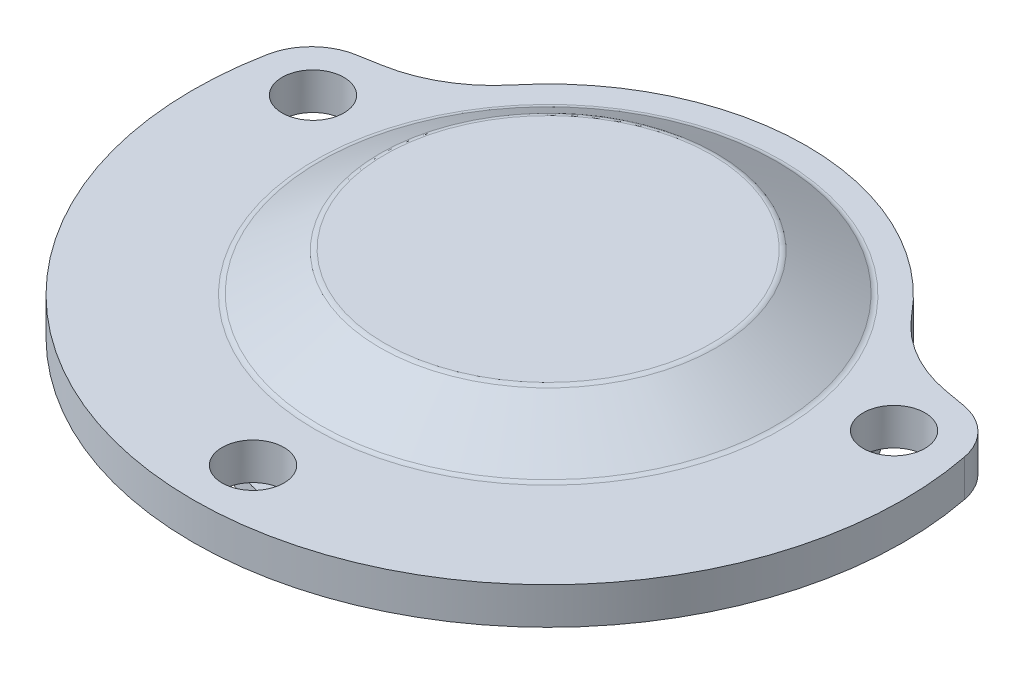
ISO-10303-21;
HEADER;
FILE_DESCRIPTION(('STEP AP214'),'2;1');
FILE_NAME('part.step','',(''),(''),'','','');
FILE_SCHEMA(('AUTOMOTIVE_DESIGN { 1 0 10303 214 1 1 1 1 }'));
ENDSEC;
DATA;
#1=APPLICATION_CONTEXT('core data for automotive mechanical design processes');
#2=APPLICATION_PROTOCOL_DEFINITION('international standard','automotive_design',2000,#1);
#3=PRODUCT_CONTEXT('',#1,'mechanical');
#4=PRODUCT('Part','Part','',(#3));
#5=PRODUCT_RELATED_PRODUCT_CATEGORY('part','',(#4));
#6=PRODUCT_DEFINITION_FORMATION('','',#4);
#7=PRODUCT_DEFINITION_CONTEXT('part definition',#1,'design');
#8=PRODUCT_DEFINITION('design','',#6,#7);
#9=PRODUCT_DEFINITION_SHAPE('','',#8);
#10=(LENGTH_UNIT() NAMED_UNIT(*) SI_UNIT(.MILLI.,.METRE.));
#11=(NAMED_UNIT(*) PLANE_ANGLE_UNIT() SI_UNIT($,.RADIAN.));
#12=(NAMED_UNIT(*) SI_UNIT($,.STERADIAN.) SOLID_ANGLE_UNIT());
#13=UNCERTAINTY_MEASURE_WITH_UNIT(LENGTH_MEASURE(1.E-05),#10,'distance_accuracy_value','');
#14=(GEOMETRIC_REPRESENTATION_CONTEXT(3) GLOBAL_UNCERTAINTY_ASSIGNED_CONTEXT((#13)) GLOBAL_UNIT_ASSIGNED_CONTEXT((#10,
#11,#12)) REPRESENTATION_CONTEXT('',''));
#15=CARTESIAN_POINT('',(0.,0.,0.));
#16=DIRECTION('',(0.,0.,1.));
#17=DIRECTION('',(1.,0.,0.));
#18=AXIS2_PLACEMENT_3D('',#15,#16,#17);
#19=CARTESIAN_POINT('',(25.,5.50000000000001,0.));
#20=DIRECTION('',(0.,1.,0.));
#21=DIRECTION('',(0.,0.,1.));
#22=AXIS2_PLACEMENT_3D('',#19,#20,#21);
#23=PLANE('',#22);
#24=CARTESIAN_POINT('',(0.,5.50000000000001,0.));
#25=DIRECTION('',(0.,1.,0.));
#26=DIRECTION('',(0.,0.,1.));
#27=AXIS2_PLACEMENT_3D('',#24,#25,#26);
#28=CIRCLE('',#27,25.2826115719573);
#29=CARTESIAN_POINT('',(0.,5.50000000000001,25.2826115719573));
#30=VERTEX_POINT('',#29);
#31=EDGE_CURVE('E161',#30,#30,#28,.F.);
#32=ORIENTED_EDGE('',*,*,#31,.T.);
#33=EDGE_LOOP('',(#32));
#34=FACE_BOUND('',#33,.T.);
#35=CARTESIAN_POINT('',(0.,5.50000000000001,32.));
#36=DIRECTION('',(0.,1.,0.));
#37=DIRECTION('',(0.,0.,1.));
#38=AXIS2_PLACEMENT_3D('',#35,#36,#37);
#39=CIRCLE('',#38,3.35);
#40=CARTESIAN_POINT('',(0.,5.50000000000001,35.35));
#41=VERTEX_POINT('',#40);
#42=EDGE_CURVE('E432',#41,#41,#39,.T.);
#43=ORIENTED_EDGE('',*,*,#42,.F.);
#44=EDGE_LOOP('',(#43));
#45=FACE_BOUND('',#44,.T.);
#46=CARTESIAN_POINT('',(-31.5,5.50000000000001,-6.));
#47=DIRECTION('',(0.,1.,0.));
#48=DIRECTION('',(0.,0.,1.));
#49=AXIS2_PLACEMENT_3D('',#46,#47,#48);
#50=CIRCLE('',#49,3.35);
#51=CARTESIAN_POINT('',(-31.5,5.50000000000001,-2.65));
#52=VERTEX_POINT('',#51);
#53=EDGE_CURVE('E438',#52,#52,#50,.T.);
#54=ORIENTED_EDGE('',*,*,#53,.F.);
#55=EDGE_LOOP('',(#54));
#56=FACE_BOUND('',#55,.T.);
#57=CARTESIAN_POINT('',(31.5,5.50000000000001,-6.));
#58=DIRECTION('',(0.,1.,0.));
#59=DIRECTION('',(0.,0.,1.));
#60=AXIS2_PLACEMENT_3D('',#57,#58,#59);
#61=CIRCLE('',#60,3.35);
#62=CARTESIAN_POINT('',(31.5,5.50000000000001,-2.65));
#63=VERTEX_POINT('',#62);
#64=EDGE_CURVE('E414',#63,#63,#61,.T.);
#65=ORIENTED_EDGE('',*,*,#64,.F.);
#66=EDGE_LOOP('',(#65));
#67=FACE_BOUND('',#66,.T.);
#68=CARTESIAN_POINT('',(0.,5.50000000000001,0.));
#69=DIRECTION('',(0.,-1.,0.));
#70=DIRECTION('',(0.,0.,-1.));
#71=AXIS2_PLACEMENT_3D('',#68,#69,#70);
#72=CIRCLE('',#71,38.5);
#73=CARTESIAN_POINT('',(37.7889401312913,5.50000000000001,-7.36518864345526));
#74=VERTEX_POINT('',#73);
#75=CARTESIAN_POINT('',(-37.7889401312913,5.50000000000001,-7.36518864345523));
#76=VERTEX_POINT('',#75);
#77=EDGE_CURVE('E129',#74,#76,#72,.T.);
#78=ORIENTED_EDGE('',*,*,#77,.F.);
#79=CARTESIAN_POINT('',(31.8997546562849,5.50000000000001,-6.21736703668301));
#80=DIRECTION('',(0.,1.,0.));
#81=DIRECTION('',(0.,0.,1.));
#82=AXIS2_PLACEMENT_3D('',#79,#80,#81);
#83=CIRCLE('',#82,6.);
#84=CARTESIAN_POINT('',(32.9416437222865,5.50000000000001,-12.1262135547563));
#85=VERTEX_POINT('',#84);
#86=EDGE_CURVE('E133',#74,#85,#83,.T.);
#87=ORIENTED_EDGE('',*,*,#86,.T.);
#88=DIRECTION('',(-0.984807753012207,0.,-0.173648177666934));
#89=VECTOR('',#88,1.);
#90=CARTESIAN_POINT('',(27.3131745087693,5.50000000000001,-13.1186645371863));
#91=LINE('',#90,#89);
#92=CARTESIAN_POINT('',(30.6095687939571,5.50000000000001,-12.5374212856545));
#93=VERTEX_POINT('',#92);
#94=EDGE_CURVE('E425',#85,#93,#91,.T.);
#95=ORIENTED_EDGE('',*,*,#94,.T.);
#96=CARTESIAN_POINT('',(33.2142914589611,5.50000000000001,-27.3095375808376));
#97=DIRECTION('',(0.,1.,0.));
#98=DIRECTION('',(0.,0.,1.));
#99=AXIS2_PLACEMENT_3D('',#96,#97,#98);
#100=CIRCLE('',#99,15.);
#101=CARTESIAN_POINT('',(21.6279107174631,5.50000000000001,-17.7829547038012));
#102=VERTEX_POINT('',#101);
#103=EDGE_CURVE('E157',#93,#102,#100,.F.);
#104=ORIENTED_EDGE('',*,*,#103,.T.);
#105=CARTESIAN_POINT('',(0.,5.50000000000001,0.));
#106=DIRECTION('',(0.,1.,0.));
#107=DIRECTION('',(0.,0.,1.));
#108=AXIS2_PLACEMENT_3D('',#105,#106,#107);
#109=CIRCLE('',#108,28.);
#110=CARTESIAN_POINT('',(-21.6279107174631,5.50000000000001,-17.7829547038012));
#111=VERTEX_POINT('',#110);
#112=EDGE_CURVE('E428',#102,#111,#109,.T.);
#113=ORIENTED_EDGE('',*,*,#112,.T.);
#114=CARTESIAN_POINT('',(-33.2142914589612,5.50000000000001,-27.3095375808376));
#115=DIRECTION('',(0.,1.,0.));
#116=DIRECTION('',(0.,0.,1.));
#117=AXIS2_PLACEMENT_3D('',#114,#115,#116);
#118=CIRCLE('',#117,15.);
#119=CARTESIAN_POINT('',(-30.6095687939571,5.50000000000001,-12.5374212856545));
#120=VERTEX_POINT('',#119);
#121=EDGE_CURVE('E54',#111,#120,#118,.F.);
#122=ORIENTED_EDGE('',*,*,#121,.T.);
#123=DIRECTION('',(-0.984807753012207,0.,0.173648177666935));
#124=VECTOR('',#123,1.);
#125=CARTESIAN_POINT('',(21.1791410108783,5.50000000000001,-21.6691681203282));
#126=LINE('',#125,#124);
#127=CARTESIAN_POINT('',(-32.9416437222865,5.50000000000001,-12.1262135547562));
#128=VERTEX_POINT('',#127);
#129=EDGE_CURVE('E423',#120,#128,#126,.T.);
#130=ORIENTED_EDGE('',*,*,#129,.T.);
#131=CARTESIAN_POINT('',(-31.8997546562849,5.50000000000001,-6.21736703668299));
#132=DIRECTION('',(0.,1.,0.));
#133=DIRECTION('',(0.,0.,1.));
#134=AXIS2_PLACEMENT_3D('',#131,#132,#133);
#135=CIRCLE('',#134,6.);
#136=EDGE_CURVE('E134',#128,#76,#135,.T.);
#137=ORIENTED_EDGE('',*,*,#136,.T.);
#138=EDGE_LOOP('',(#78,#87,#95,#104,#113,#122,#130,#137));
#139=FACE_BOUND('',#138,.T.);
#140=ADVANCED_FACE('F39',(#34,#45,#56,#67,#139),#23,.T.);
#141=CARTESIAN_POINT('',(0.,0.,0.));
#142=DIRECTION('',(0.,-1.,0.));
#143=DIRECTION('',(0.,0.,-1.));
#144=AXIS2_PLACEMENT_3D('',#141,#142,#143);
#145=CYLINDRICAL_SURFACE('',#144,38.5);
#146=CARTESIAN_POINT('',(0.,1.50000000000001,0.));
#147=DIRECTION('',(0.,-1.,0.));
#148=DIRECTION('',(0.,0.,-1.));
#149=AXIS2_PLACEMENT_3D('',#146,#147,#148);
#150=CIRCLE('',#149,38.5);
#151=CARTESIAN_POINT('',(37.7889401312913,1.50000000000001,-7.36518864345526));
#152=VERTEX_POINT('',#151);
#153=CARTESIAN_POINT('',(-37.7889401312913,1.50000000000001,-7.36518864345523));
#154=VERTEX_POINT('',#153);
#155=EDGE_CURVE('E110',#152,#154,#150,.T.);
#156=ORIENTED_EDGE('',*,*,#155,.F.);
#157=DIRECTION('',(0.,-1.,0.));
#158=VECTOR('',#157,1.);
#159=CARTESIAN_POINT('',(37.7889401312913,0.,-7.36518864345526));
#160=LINE('',#159,#158);
#161=EDGE_CURVE('E125',#152,#74,#160,.F.);
#162=ORIENTED_EDGE('',*,*,#161,.T.);
#163=ORIENTED_EDGE('',*,*,#77,.T.);
#164=DIRECTION('',(0.,-1.,0.));
#165=VECTOR('',#164,1.);
#166=CARTESIAN_POINT('',(-37.7889401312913,0.,-7.36518864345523));
#167=LINE('',#166,#165);
#168=EDGE_CURVE('E128',#76,#154,#167,.T.);
#169=ORIENTED_EDGE('',*,*,#168,.T.);
#170=EDGE_LOOP('',(#156,#162,#163,#169));
#171=FACE_BOUND('',#170,.T.);
#172=ADVANCED_FACE('F123',(#171),#145,.T.);
#173=CARTESIAN_POINT('',(38.5,1.5,0.));
#174=DIRECTION('',(0.,-1.,0.));
#175=DIRECTION('',(0.,0.,-1.));
#176=AXIS2_PLACEMENT_3D('',#173,#174,#175);
#177=PLANE('',#176);
#178=CARTESIAN_POINT('',(0.,1.5,32.));
#179=DIRECTION('',(0.,-1.,0.));
#180=DIRECTION('',(0.,0.,-1.));
#181=AXIS2_PLACEMENT_3D('',#178,#179,#180);
#182=CIRCLE('',#181,3.35);
#183=CARTESIAN_POINT('',(0.,1.5,28.65));
#184=VERTEX_POINT('',#183);
#185=EDGE_CURVE('E435',#184,#184,#182,.T.);
#186=ORIENTED_EDGE('',*,*,#185,.F.);
#187=EDGE_LOOP('',(#186));
#188=FACE_BOUND('',#187,.T.);
#189=CARTESIAN_POINT('',(-31.5,1.5,-6.));
#190=DIRECTION('',(0.,-1.,0.));
#191=DIRECTION('',(0.,0.,-1.));
#192=AXIS2_PLACEMENT_3D('',#189,#190,#191);
#193=CIRCLE('',#192,3.35);
#194=CARTESIAN_POINT('',(-31.5,1.5,-9.35));
#195=VERTEX_POINT('',#194);
#196=EDGE_CURVE('E441',#195,#195,#193,.T.);
#197=ORIENTED_EDGE('',*,*,#196,.F.);
#198=EDGE_LOOP('',(#197));
#199=FACE_BOUND('',#198,.T.);
#200=CARTESIAN_POINT('',(31.5,1.5,-6.));
#201=DIRECTION('',(0.,-1.,0.));
#202=DIRECTION('',(0.,0.,-1.));
#203=AXIS2_PLACEMENT_3D('',#200,#201,#202);
#204=CIRCLE('',#203,3.35);
#205=CARTESIAN_POINT('',(31.5,1.5,-9.35));
#206=VERTEX_POINT('',#205);
#207=EDGE_CURVE('E410',#206,#206,#204,.T.);
#208=ORIENTED_EDGE('',*,*,#207,.F.);
#209=EDGE_LOOP('',(#208));
#210=FACE_BOUND('',#209,.T.);
#211=CARTESIAN_POINT('',(0.,1.5,0.));
#212=DIRECTION('',(0.,-1.,0.));
#213=DIRECTION('',(0.,0.,-1.));
#214=AXIS2_PLACEMENT_3D('',#211,#212,#213);
#215=CIRCLE('',#214,26.);
#216=CARTESIAN_POINT('',(0.,1.5,-26.));
#217=VERTEX_POINT('',#216);
#218=EDGE_CURVE('E130',#217,#217,#215,.T.);
#219=ORIENTED_EDGE('',*,*,#218,.F.);
#220=EDGE_LOOP('',(#219));
#221=FACE_BOUND('',#220,.T.);
#222=CARTESIAN_POINT('',(0.,1.5,0.));
#223=DIRECTION('',(0.,-1.,0.));
#224=DIRECTION('',(0.,0.,-1.));
#225=AXIS2_PLACEMENT_3D('',#222,#223,#224);
#226=CIRCLE('',#225,28.);
#227=CARTESIAN_POINT('',(-21.6279107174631,1.5,-17.7829547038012));
#228=VERTEX_POINT('',#227);
#229=CARTESIAN_POINT('',(21.6279107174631,1.5,-17.7829547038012));
#230=VERTEX_POINT('',#229);
#231=EDGE_CURVE('E417',#228,#230,#226,.T.);
#232=ORIENTED_EDGE('',*,*,#231,.T.);
#233=CARTESIAN_POINT('',(33.2142914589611,1.5,-27.3095375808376));
#234=DIRECTION('',(0.,-1.,0.));
#235=DIRECTION('',(0.,0.,-1.));
#236=AXIS2_PLACEMENT_3D('',#233,#234,#235);
#237=CIRCLE('',#236,15.);
#238=CARTESIAN_POINT('',(30.6095687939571,1.5,-12.5374212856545));
#239=VERTEX_POINT('',#238);
#240=EDGE_CURVE('E155',#230,#239,#237,.F.);
#241=ORIENTED_EDGE('',*,*,#240,.T.);
#242=DIRECTION('',(0.984807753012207,0.,0.173648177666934));
#243=VECTOR('',#242,1.);
#244=CARTESIAN_POINT('',(40.4060996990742,1.5,-10.810028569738));
#245=LINE('',#244,#243);
#246=CARTESIAN_POINT('',(32.9416437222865,1.5,-12.1262135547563));
#247=VERTEX_POINT('',#246);
#248=EDGE_CURVE('E112',#239,#247,#245,.T.);
#249=ORIENTED_EDGE('',*,*,#248,.T.);
#250=CARTESIAN_POINT('',(31.8997546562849,1.5,-6.21736703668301));
#251=DIRECTION('',(0.,-1.,0.));
#252=DIRECTION('',(0.,0.,-1.));
#253=AXIS2_PLACEMENT_3D('',#250,#251,#252);
#254=CIRCLE('',#253,6.);
#255=EDGE_CURVE('E106',#247,#152,#254,.T.);
#256=ORIENTED_EDGE('',*,*,#255,.T.);
#257=ORIENTED_EDGE('',*,*,#155,.T.);
#258=CARTESIAN_POINT('',(-31.8997546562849,1.5,-6.21736703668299));
#259=DIRECTION('',(0.,-1.,0.));
#260=DIRECTION('',(0.,0.,-1.));
#261=AXIS2_PLACEMENT_3D('',#258,#259,#260);
#262=CIRCLE('',#261,6.);
#263=CARTESIAN_POINT('',(-32.9416437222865,1.5,-12.1262135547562));
#264=VERTEX_POINT('',#263);
#265=EDGE_CURVE('E118',#154,#264,#262,.T.);
#266=ORIENTED_EDGE('',*,*,#265,.T.);
#267=DIRECTION('',(0.984807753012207,0.,-0.173648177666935));
#268=VECTOR('',#267,1.);
#269=CARTESIAN_POINT('',(34.2720662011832,1.5,-23.9778040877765));
#270=LINE('',#269,#268);
#271=CARTESIAN_POINT('',(-30.6095687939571,1.5,-12.5374212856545));
#272=VERTEX_POINT('',#271);
#273=EDGE_CURVE('E409',#264,#272,#270,.T.);
#274=ORIENTED_EDGE('',*,*,#273,.T.);
#275=CARTESIAN_POINT('',(-33.2142914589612,1.5,-27.3095375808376));
#276=DIRECTION('',(0.,-1.,0.));
#277=DIRECTION('',(0.,0.,-1.));
#278=AXIS2_PLACEMENT_3D('',#275,#276,#277);
#279=CIRCLE('',#278,15.);
#280=EDGE_CURVE('E62',#272,#228,#279,.F.);
#281=ORIENTED_EDGE('',*,*,#280,.T.);
#282=EDGE_LOOP('',(#232,#241,#249,#256,#257,#266,#274,#281));
#283=FACE_BOUND('',#282,.T.);
#284=ADVANCED_FACE('F109',(#188,#199,#210,#221,#283),#177,.T.);
#285=CARTESIAN_POINT('',(19.,5.,0.));
#286=DIRECTION('',(0.,-1.,0.));
#287=DIRECTION('',(0.,0.,-1.));
#288=AXIS2_PLACEMENT_3D('',#285,#286,#287);
#289=PLANE('',#288);
#290=CARTESIAN_POINT('',(0.,5.,0.));
#291=DIRECTION('',(0.,-1.,0.));
#292=DIRECTION('',(0.,0.,-1.));
#293=AXIS2_PLACEMENT_3D('',#290,#291,#292);
#294=CIRCLE('',#293,18.);
#295=CARTESIAN_POINT('',(0.,5.,-18.));
#296=VERTEX_POINT('',#295);
#297=EDGE_CURVE('E47',#296,#296,#294,.T.);
#298=ORIENTED_EDGE('',*,*,#297,.T.);
#299=EDGE_LOOP('',(#298));
#300=FACE_BOUND('',#299,.T.);
#301=ADVANCED_FACE('F175',(#300),#289,.T.);
#302=CARTESIAN_POINT('',(0.,9.8,0.));
#303=DIRECTION('',(0.,1.,0.));
#304=DIRECTION('',(0.,0.,1.));
#305=AXIS2_PLACEMENT_3D('',#302,#303,#304);
#306=PLANE('',#305);
#307=CARTESIAN_POINT('',(0.,9.8,0.));
#308=DIRECTION('',(0.,1.,0.));
#309=DIRECTION('',(0.,0.,1.));
#310=AXIS2_PLACEMENT_3D('',#307,#308,#309);
#311=CIRCLE('',#310,17.7173884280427);
#312=CARTESIAN_POINT('',(0.,9.8,17.7173884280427));
#313=VERTEX_POINT('',#312);
#314=EDGE_CURVE('E170',#313,#313,#311,.T.);
#315=ORIENTED_EDGE('',*,*,#314,.T.);
#316=EDGE_LOOP('',(#315));
#317=FACE_BOUND('',#316,.T.);
#318=ADVANCED_FACE('F203',(#317),#306,.T.);
#319=CARTESIAN_POINT('',(0.,5.50000000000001,0.));
#320=DIRECTION('',(0.,-1.,0.));
#321=DIRECTION('',(0.,0.,-1.));
#322=AXIS2_PLACEMENT_3D('',#319,#320,#321);
#323=CONICAL_SURFACE('',#322,25.,1.01993879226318);
#324=CARTESIAN_POINT('',(0.,5.64792401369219,0.));
#325=DIRECTION('',(0.,-1.,0.));
#326=DIRECTION('',(0.,0.,-1.));
#327=AXIS2_PLACEMENT_3D('',#324,#325,#326);
#328=CIRCLE('',#327,24.7591934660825);
#329=CARTESIAN_POINT('',(0.,5.64792401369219,-24.7591934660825));
#330=VERTEX_POINT('',#329);
#331=EDGE_CURVE('E167',#330,#330,#328,.F.);
#332=ORIENTED_EDGE('',*,*,#331,.T.);
#333=EDGE_LOOP('',(#332));
#334=FACE_BOUND('',#333,.T.);
#335=CARTESIAN_POINT('',(0.,9.65207598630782,0.));
#336=DIRECTION('',(0.,1.,0.));
#337=DIRECTION('',(0.,0.,1.));
#338=AXIS2_PLACEMENT_3D('',#335,#336,#337);
#339=CIRCLE('',#338,18.2408065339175);
#340=CARTESIAN_POINT('',(0.,9.65207598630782,18.2408065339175));
#341=VERTEX_POINT('',#340);
#342=EDGE_CURVE('E164',#341,#341,#339,.F.);
#343=ORIENTED_EDGE('',*,*,#342,.T.);
#344=EDGE_LOOP('',(#343));
#345=FACE_BOUND('',#344,.T.);
#346=ADVANCED_FACE('F199',(#334,#345),#323,.T.);
#347=CARTESIAN_POINT('',(0.,0.,0.));
#348=DIRECTION('',(0.,-1.,0.));
#349=DIRECTION('',(0.,0.,-1.));
#350=AXIS2_PLACEMENT_3D('',#347,#348,#349);
#351=CYLINDRICAL_SURFACE('',#350,26.);
#352=ORIENTED_EDGE('',*,*,#218,.T.);
#353=EDGE_LOOP('',(#352));
#354=FACE_BOUND('',#353,.T.);
#355=CARTESIAN_POINT('',(0.,-0.199999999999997,0.));
#356=DIRECTION('',(0.,-1.,0.));
#357=DIRECTION('',(0.,0.,-1.));
#358=AXIS2_PLACEMENT_3D('',#355,#356,#357);
#359=CIRCLE('',#358,26.);
#360=CARTESIAN_POINT('',(0.,-0.199999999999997,-26.));
#361=VERTEX_POINT('',#360);
#362=EDGE_CURVE('E399',#361,#361,#359,.T.);
#363=ORIENTED_EDGE('',*,*,#362,.F.);
#364=EDGE_LOOP('',(#363));
#365=FACE_BOUND('',#364,.T.);
#366=ADVANCED_FACE('F202',(#354,#365),#351,.T.);
#367=CARTESIAN_POINT('',(26.,-0.199999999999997,0.));
#368=DIRECTION('',(0.,-1.,0.));
#369=DIRECTION('',(0.,0.,-1.));
#370=AXIS2_PLACEMENT_3D('',#367,#368,#369);
#371=PLANE('',#370);
#372=ORIENTED_EDGE('',*,*,#362,.T.);
#373=EDGE_LOOP('',(#372));
#374=FACE_BOUND('',#373,.T.);
#375=CARTESIAN_POINT('',(0.,-0.199999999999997,0.));
#376=DIRECTION('',(0.,-1.,0.));
#377=DIRECTION('',(0.,0.,-1.));
#378=AXIS2_PLACEMENT_3D('',#375,#376,#377);
#379=CIRCLE('',#378,23.9);
#380=CARTESIAN_POINT('',(0.,-0.199999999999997,-23.9));
#381=VERTEX_POINT('',#380);
#382=EDGE_CURVE('E400',#381,#381,#379,.T.);
#383=ORIENTED_EDGE('',*,*,#382,.F.);
#384=EDGE_LOOP('',(#383));
#385=FACE_BOUND('',#384,.T.);
#386=ADVANCED_FACE('F385',(#374,#385),#371,.T.);
#387=CARTESIAN_POINT('',(0.,0.,0.));
#388=DIRECTION('',(0.,-1.,0.));
#389=DIRECTION('',(0.,0.,-1.));
#390=AXIS2_PLACEMENT_3D('',#387,#388,#389);
#391=CYLINDRICAL_SURFACE('',#390,23.9);
#392=ORIENTED_EDGE('',*,*,#382,.T.);
#393=EDGE_LOOP('',(#392));
#394=FACE_BOUND('',#393,.T.);
#395=CARTESIAN_POINT('',(0.,-3.5,0.));
#396=DIRECTION('',(0.,-1.,0.));
#397=DIRECTION('',(0.,0.,-1.));
#398=AXIS2_PLACEMENT_3D('',#395,#396,#397);
#399=CIRCLE('',#398,23.9);
#400=CARTESIAN_POINT('',(0.,-3.5,-23.9));
#401=VERTEX_POINT('',#400);
#402=EDGE_CURVE('E404',#401,#401,#399,.T.);
#403=ORIENTED_EDGE('',*,*,#402,.F.);
#404=EDGE_LOOP('',(#403));
#405=FACE_BOUND('',#404,.T.);
#406=ADVANCED_FACE('F381',(#394,#405),#391,.T.);
#407=CARTESIAN_POINT('',(23.9,-3.5,0.));
#408=DIRECTION('',(0.,1.,0.));
#409=DIRECTION('',(0.,0.,1.));
#410=AXIS2_PLACEMENT_3D('',#407,#408,#409);
#411=PLANE('',#410);
#412=ORIENTED_EDGE('',*,*,#402,.T.);
#413=EDGE_LOOP('',(#412));
#414=FACE_BOUND('',#413,.T.);
#415=CARTESIAN_POINT('',(0.,-3.5,0.));
#416=DIRECTION('',(0.,-1.,0.));
#417=DIRECTION('',(0.,0.,-1.));
#418=AXIS2_PLACEMENT_3D('',#415,#416,#417);
#419=CIRCLE('',#418,26.);
#420=CARTESIAN_POINT('',(0.,-3.5,-26.));
#421=VERTEX_POINT('',#420);
#422=EDGE_CURVE('E451',#421,#421,#419,.T.);
#423=ORIENTED_EDGE('',*,*,#422,.F.);
#424=EDGE_LOOP('',(#423));
#425=FACE_BOUND('',#424,.T.);
#426=ADVANCED_FACE('F377',(#414,#425),#411,.T.);
#427=CARTESIAN_POINT('',(0.,0.,0.));
#428=DIRECTION('',(0.,-1.,0.));
#429=DIRECTION('',(0.,0.,-1.));
#430=AXIS2_PLACEMENT_3D('',#427,#428,#429);
#431=CYLINDRICAL_SURFACE('',#430,26.);
#432=ORIENTED_EDGE('',*,*,#422,.T.);
#433=EDGE_LOOP('',(#432));
#434=FACE_BOUND('',#433,.T.);
#435=CARTESIAN_POINT('',(0.,-5.5,0.));
#436=DIRECTION('',(0.,-1.,0.));
#437=DIRECTION('',(0.,0.,-1.));
#438=AXIS2_PLACEMENT_3D('',#435,#436,#437);
#439=CIRCLE('',#438,26.);
#440=CARTESIAN_POINT('',(0.,-5.5,-26.));
#441=VERTEX_POINT('',#440);
#442=EDGE_CURVE('E448',#441,#441,#439,.T.);
#443=ORIENTED_EDGE('',*,*,#442,.F.);
#444=EDGE_LOOP('',(#443));
#445=FACE_BOUND('',#444,.T.);
#446=ADVANCED_FACE('F373',(#434,#445),#431,.T.);
#447=CARTESIAN_POINT('',(26.,-5.5,0.));
#448=DIRECTION('',(0.,-1.,0.));
#449=DIRECTION('',(0.,0.,-1.));
#450=AXIS2_PLACEMENT_3D('',#447,#448,#449);
#451=PLANE('',#450);
#452=ORIENTED_EDGE('',*,*,#442,.T.);
#453=EDGE_LOOP('',(#452));
#454=FACE_BOUND('',#453,.T.);
#455=CARTESIAN_POINT('',(0.,-5.5,0.));
#456=DIRECTION('',(0.,-1.,0.));
#457=DIRECTION('',(0.,0.,-1.));
#458=AXIS2_PLACEMENT_3D('',#455,#456,#457);
#459=CIRCLE('',#458,19.);
#460=CARTESIAN_POINT('',(0.,-5.5,-19.));
#461=VERTEX_POINT('',#460);
#462=EDGE_CURVE('E413',#461,#461,#459,.T.);
#463=ORIENTED_EDGE('',*,*,#462,.F.);
#464=EDGE_LOOP('',(#463));
#465=FACE_BOUND('',#464,.T.);
#466=ADVANCED_FACE('F253',(#454,#465),#451,.T.);
#467=CARTESIAN_POINT('',(0.,0.,0.));
#468=DIRECTION('',(0.,-1.,0.));
#469=DIRECTION('',(0.,0.,-1.));
#470=AXIS2_PLACEMENT_3D('',#467,#468,#469);
#471=CYLINDRICAL_SURFACE('',#470,19.);
#472=CARTESIAN_POINT('',(0.,4.,0.));
#473=DIRECTION('',(0.,-1.,0.));
#474=DIRECTION('',(0.,0.,-1.));
#475=AXIS2_PLACEMENT_3D('',#472,#473,#474);
#476=CIRCLE('',#475,19.);
#477=CARTESIAN_POINT('',(0.,4.,-19.));
#478=VERTEX_POINT('',#477);
#479=EDGE_CURVE('E11',#478,#478,#476,.F.);
#480=ORIENTED_EDGE('',*,*,#479,.T.);
#481=EDGE_LOOP('',(#480));
#482=FACE_BOUND('',#481,.T.);
#483=ORIENTED_EDGE('',*,*,#462,.T.);
#484=EDGE_LOOP('',(#483));
#485=FACE_BOUND('',#484,.T.);
#486=ADVANCED_FACE('F249',(#482,#485),#471,.F.);
#487=CARTESIAN_POINT('',(31.5,5.50000000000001,-6.));
#488=DIRECTION('',(0.,1.,0.));
#489=DIRECTION('',(0.,0.,1.));
#490=AXIS2_PLACEMENT_3D('',#487,#488,#489);
#491=CYLINDRICAL_SURFACE('',#490,3.35);
#492=ORIENTED_EDGE('',*,*,#207,.T.);
#493=EDGE_LOOP('',(#492));
#494=FACE_BOUND('',#493,.T.);
#495=ORIENTED_EDGE('',*,*,#64,.T.);
#496=EDGE_LOOP('',(#495));
#497=FACE_BOUND('',#496,.T.);
#498=ADVANCED_FACE('F252',(#494,#497),#491,.F.);
#499=CARTESIAN_POINT('',(-31.5,5.50000000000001,-6.));
#500=DIRECTION('',(0.,1.,0.));
#501=DIRECTION('',(0.,0.,1.));
#502=AXIS2_PLACEMENT_3D('',#499,#500,#501);
#503=CYLINDRICAL_SURFACE('',#502,3.35);
#504=ORIENTED_EDGE('',*,*,#196,.T.);
#505=EDGE_LOOP('',(#504));
#506=FACE_BOUND('',#505,.T.);
#507=ORIENTED_EDGE('',*,*,#53,.T.);
#508=EDGE_LOOP('',(#507));
#509=FACE_BOUND('',#508,.T.);
#510=ADVANCED_FACE('F272',(#506,#509),#503,.F.);
#511=CARTESIAN_POINT('',(0.,5.50000000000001,32.));
#512=DIRECTION('',(0.,1.,0.));
#513=DIRECTION('',(0.,0.,1.));
#514=AXIS2_PLACEMENT_3D('',#511,#512,#513);
#515=CYLINDRICAL_SURFACE('',#514,3.35);
#516=ORIENTED_EDGE('',*,*,#185,.T.);
#517=EDGE_LOOP('',(#516));
#518=FACE_BOUND('',#517,.T.);
#519=ORIENTED_EDGE('',*,*,#42,.T.);
#520=EDGE_LOOP('',(#519));
#521=FACE_BOUND('',#520,.T.);
#522=ADVANCED_FACE('F282',(#518,#521),#515,.F.);
#523=CARTESIAN_POINT('',(0.,10.,0.));
#524=DIRECTION('',(0.,-1.,0.));
#525=DIRECTION('',(0.,0.,-1.));
#526=AXIS2_PLACEMENT_3D('',#523,#524,#525);
#527=CYLINDRICAL_SURFACE('',#526,28.);
#528=ORIENTED_EDGE('',*,*,#112,.F.);
#529=DIRECTION('',(0.,-1.,0.));
#530=VECTOR('',#529,1.);
#531=CARTESIAN_POINT('',(21.6279107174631,10.,-17.7829547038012));
#532=LINE('',#531,#530);
#533=EDGE_CURVE('E148',#102,#230,#532,.T.);
#534=ORIENTED_EDGE('',*,*,#533,.T.);
#535=ORIENTED_EDGE('',*,*,#231,.F.);
#536=DIRECTION('',(0.,-1.,0.));
#537=VECTOR('',#536,1.);
#538=CARTESIAN_POINT('',(-21.6279107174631,10.,-17.7829547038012));
#539=LINE('',#538,#537);
#540=EDGE_CURVE('E146',#228,#111,#539,.F.);
#541=ORIENTED_EDGE('',*,*,#540,.T.);
#542=EDGE_LOOP('',(#528,#534,#535,#541));
#543=FACE_BOUND('',#542,.T.);
#544=ADVANCED_FACE('F292',(#543),#527,.T.);
#545=CARTESIAN_POINT('',(45.0000000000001,10.,-10.));
#546=DIRECTION('',(0.173648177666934,0.,-0.984807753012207));
#547=DIRECTION('',(-0.984807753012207,0.,-0.173648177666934));
#548=AXIS2_PLACEMENT_3D('',#545,#546,#547);
#549=PLANE('',#548);
#550=ORIENTED_EDGE('',*,*,#248,.F.);
#551=DIRECTION('',(0.,1.,0.));
#552=VECTOR('',#551,1.);
#553=CARTESIAN_POINT('',(30.6095687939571,5.50000000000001,-12.5374212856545));
#554=LINE('',#553,#552);
#555=EDGE_CURVE('E151',#239,#93,#554,.T.);
#556=ORIENTED_EDGE('',*,*,#555,.T.);
#557=ORIENTED_EDGE('',*,*,#94,.F.);
#558=DIRECTION('',(0.,-1.,0.));
#559=VECTOR('',#558,1.);
#560=CARTESIAN_POINT('',(32.9416437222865,10.,-12.1262135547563));
#561=LINE('',#560,#559);
#562=EDGE_CURVE('E141',#85,#247,#561,.T.);
#563=ORIENTED_EDGE('',*,*,#562,.T.);
#564=EDGE_LOOP('',(#550,#556,#557,#563));
#565=FACE_BOUND('',#564,.T.);
#566=ADVANCED_FACE('F318',(#565),#549,.T.);
#567=CARTESIAN_POINT('',(-44.9999999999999,10.,-10.));
#568=DIRECTION('',(-0.173648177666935,0.,-0.984807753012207));
#569=DIRECTION('',(-0.984807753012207,0.,0.173648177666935));
#570=AXIS2_PLACEMENT_3D('',#567,#568,#569);
#571=PLANE('',#570);
#572=ORIENTED_EDGE('',*,*,#129,.F.);
#573=DIRECTION('',(0.,1.,0.));
#574=VECTOR('',#573,1.);
#575=CARTESIAN_POINT('',(-30.6095687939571,1.5,-12.5374212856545));
#576=LINE('',#575,#574);
#577=EDGE_CURVE('E153',#120,#272,#576,.F.);
#578=ORIENTED_EDGE('',*,*,#577,.T.);
#579=ORIENTED_EDGE('',*,*,#273,.F.);
#580=DIRECTION('',(0.,-1.,0.));
#581=VECTOR('',#580,1.);
#582=CARTESIAN_POINT('',(-32.9416437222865,10.,-12.1262135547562));
#583=LINE('',#582,#581);
#584=EDGE_CURVE('E117',#264,#128,#583,.F.);
#585=ORIENTED_EDGE('',*,*,#584,.T.);
#586=EDGE_LOOP('',(#572,#578,#579,#585));
#587=FACE_BOUND('',#586,.T.);
#588=ADVANCED_FACE('F212',(#587),#571,.T.);
#589=CARTESIAN_POINT('',(31.8997546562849,0.,-6.21736703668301));
#590=DIRECTION('',(0.,-1.,0.));
#591=DIRECTION('',(0.,0.,-1.));
#592=AXIS2_PLACEMENT_3D('',#589,#590,#591);
#593=CYLINDRICAL_SURFACE('',#592,6.);
#594=ORIENTED_EDGE('',*,*,#255,.F.);
#595=ORIENTED_EDGE('',*,*,#562,.F.);
#596=ORIENTED_EDGE('',*,*,#86,.F.);
#597=ORIENTED_EDGE('',*,*,#161,.F.);
#598=EDGE_LOOP('',(#594,#595,#596,#597));
#599=FACE_BOUND('',#598,.T.);
#600=ADVANCED_FACE('F132',(#599),#593,.T.);
#601=CARTESIAN_POINT('',(-31.8997546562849,0.,-6.21736703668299));
#602=DIRECTION('',(0.,-1.,0.));
#603=DIRECTION('',(0.,0.,-1.));
#604=AXIS2_PLACEMENT_3D('',#601,#602,#603);
#605=CYLINDRICAL_SURFACE('',#604,6.);
#606=ORIENTED_EDGE('',*,*,#136,.F.);
#607=ORIENTED_EDGE('',*,*,#584,.F.);
#608=ORIENTED_EDGE('',*,*,#265,.F.);
#609=ORIENTED_EDGE('',*,*,#168,.F.);
#610=EDGE_LOOP('',(#606,#607,#608,#609));
#611=FACE_BOUND('',#610,.T.);
#612=ADVANCED_FACE('F211',(#611),#605,.T.);
#613=CARTESIAN_POINT('',(33.2142914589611,10.,-27.3095375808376));
#614=DIRECTION('',(0.,-1.,0.));
#615=DIRECTION('',(0.,0.,-1.));
#616=AXIS2_PLACEMENT_3D('',#613,#614,#615);
#617=CYLINDRICAL_SURFACE('',#616,15.);
#618=ORIENTED_EDGE('',*,*,#103,.F.);
#619=ORIENTED_EDGE('',*,*,#555,.F.);
#620=ORIENTED_EDGE('',*,*,#240,.F.);
#621=ORIENTED_EDGE('',*,*,#533,.F.);
#622=EDGE_LOOP('',(#618,#619,#620,#621));
#623=FACE_BOUND('',#622,.T.);
#624=ADVANCED_FACE('F215',(#623),#617,.F.);
#625=CARTESIAN_POINT('',(-33.2142914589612,10.,-27.3095375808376));
#626=DIRECTION('',(0.,-1.,0.));
#627=DIRECTION('',(0.,0.,-1.));
#628=AXIS2_PLACEMENT_3D('',#625,#626,#627);
#629=CYLINDRICAL_SURFACE('',#628,15.);
#630=ORIENTED_EDGE('',*,*,#121,.F.);
#631=ORIENTED_EDGE('',*,*,#540,.F.);
#632=ORIENTED_EDGE('',*,*,#280,.F.);
#633=ORIENTED_EDGE('',*,*,#577,.F.);
#634=EDGE_LOOP('',(#630,#631,#632,#633));
#635=FACE_BOUND('',#634,.T.);
#636=ADVANCED_FACE('F219',(#635),#629,.F.);
#637=CARTESIAN_POINT('',(0.,6.50000000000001,0.));
#638=DIRECTION('',(0.,1.,0.));
#639=DIRECTION('',(0.,0.,1.));
#640=AXIS2_PLACEMENT_3D('',#637,#638,#639);
#641=TOROIDAL_SURFACE('',#640,25.2826115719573,1.);
#642=ORIENTED_EDGE('',*,*,#331,.F.);
#643=EDGE_LOOP('',(#642));
#644=FACE_BOUND('',#643,.T.);
#645=ORIENTED_EDGE('',*,*,#31,.F.);
#646=EDGE_LOOP('',(#645));
#647=FACE_BOUND('',#646,.T.);
#648=ADVANCED_FACE('F184',(#644,#647),#641,.F.);
#649=CARTESIAN_POINT('',(0.,8.8,0.));
#650=DIRECTION('',(0.,1.,0.));
#651=DIRECTION('',(0.,0.,1.));
#652=AXIS2_PLACEMENT_3D('',#649,#650,#651);
#653=TOROIDAL_SURFACE('',#652,17.7173884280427,1.);
#654=ORIENTED_EDGE('',*,*,#314,.F.);
#655=EDGE_LOOP('',(#654));
#656=FACE_BOUND('',#655,.T.);
#657=ORIENTED_EDGE('',*,*,#342,.F.);
#658=EDGE_LOOP('',(#657));
#659=FACE_BOUND('',#658,.T.);
#660=ADVANCED_FACE('F178',(#656,#659),#653,.T.);
#661=CARTESIAN_POINT('',(0.,4.,0.));
#662=DIRECTION('',(0.,-1.,0.));
#663=DIRECTION('',(0.,0.,-1.));
#664=AXIS2_PLACEMENT_3D('',#661,#662,#663);
#665=TOROIDAL_SURFACE('',#664,18.,1.);
#666=ORIENTED_EDGE('',*,*,#479,.F.);
#667=EDGE_LOOP('',(#666));
#668=FACE_BOUND('',#667,.T.);
#669=ORIENTED_EDGE('',*,*,#297,.F.);
#670=EDGE_LOOP('',(#669));
#671=FACE_BOUND('',#670,.T.);
#672=ADVANCED_FACE('F41',(#668,#671),#665,.F.);
#673=CLOSED_SHELL('',(#140,#172,#284,#301,#318,#346,#366,#386,#406,#426,#446,#466,#486,#498,
#510,#522,#544,#566,#588,#600,#612,#624,#636,#648,#660,#672));
#674=MANIFOLD_SOLID_BREP('B2',#673);
#675=ADVANCED_BREP_SHAPE_REPRESENTATION('',(#18,#674),#14);
#676=SHAPE_DEFINITION_REPRESENTATION(#9,#675);
ENDSEC;
END-ISO-10303-21;
